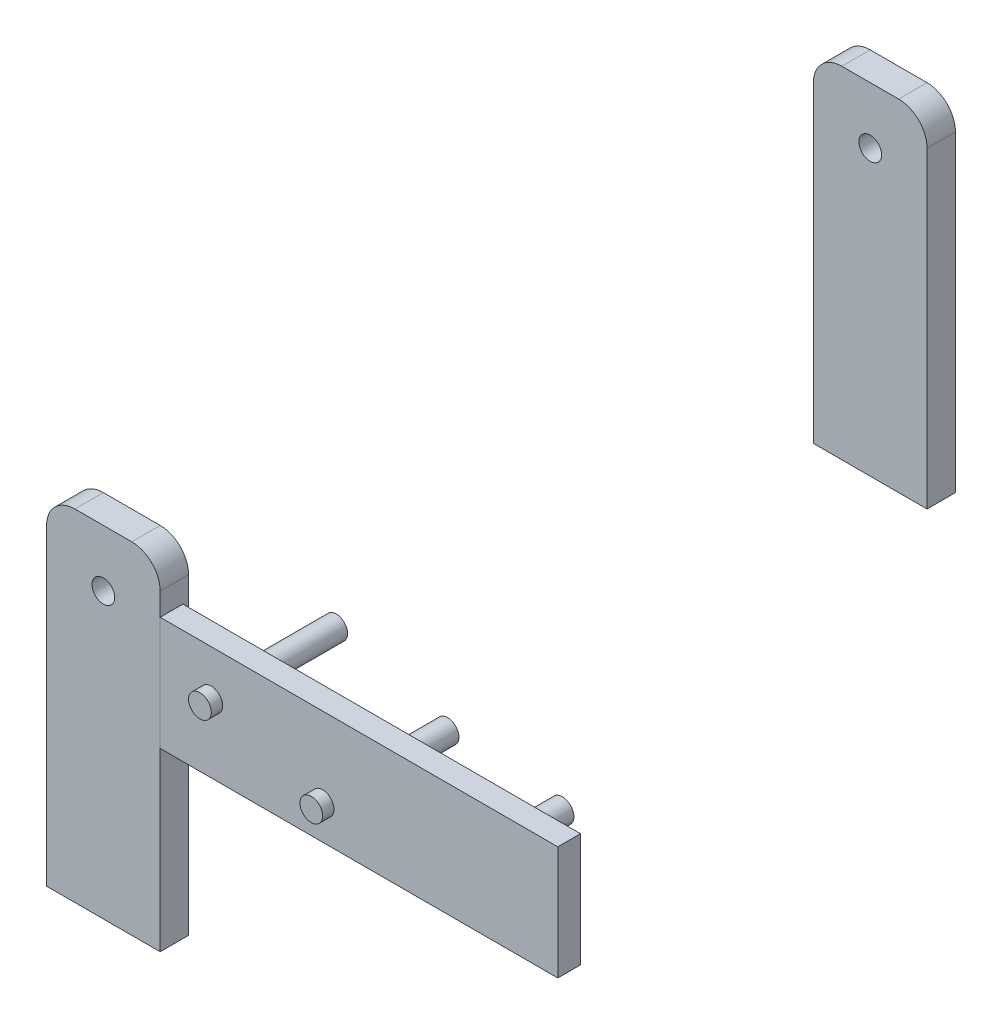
ISO-10303-21;
HEADER;
FILE_DESCRIPTION(('STEP AP214'),'2;1');
FILE_NAME('part.step','',(''),(''),'','','');
FILE_SCHEMA(('AUTOMOTIVE_DESIGN { 1 0 10303 214 1 1 1 1 }'));
ENDSEC;
DATA;
#1=APPLICATION_CONTEXT('core data for automotive mechanical design processes');
#2=APPLICATION_PROTOCOL_DEFINITION('international standard','automotive_design',2000,#1);
#3=PRODUCT_CONTEXT('',#1,'mechanical');
#4=PRODUCT('Part','Part','',(#3));
#5=PRODUCT_RELATED_PRODUCT_CATEGORY('part','',(#4));
#6=PRODUCT_DEFINITION_FORMATION('','',#4);
#7=PRODUCT_DEFINITION_CONTEXT('part definition',#1,'design');
#8=PRODUCT_DEFINITION('design','',#6,#7);
#9=PRODUCT_DEFINITION_SHAPE('','',#8);
#10=(LENGTH_UNIT() NAMED_UNIT(*) SI_UNIT(.MILLI.,.METRE.));
#11=(NAMED_UNIT(*) PLANE_ANGLE_UNIT() SI_UNIT($,.RADIAN.));
#12=(NAMED_UNIT(*) SI_UNIT($,.STERADIAN.) SOLID_ANGLE_UNIT());
#13=UNCERTAINTY_MEASURE_WITH_UNIT(LENGTH_MEASURE(1.E-05),#10,'distance_accuracy_value','');
#14=(GEOMETRIC_REPRESENTATION_CONTEXT(3) GLOBAL_UNCERTAINTY_ASSIGNED_CONTEXT((#13)) GLOBAL_UNIT_ASSIGNED_CONTEXT((#10,
#11,#12)) REPRESENTATION_CONTEXT('',''));
#15=CARTESIAN_POINT('',(0.,0.,0.));
#16=DIRECTION('',(0.,0.,1.));
#17=DIRECTION('',(1.,0.,0.));
#18=AXIS2_PLACEMENT_3D('',#15,#16,#17);
#19=CARTESIAN_POINT('',(44.0575616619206,10.5,68.));
#20=DIRECTION('',(0.,0.,1.));
#21=DIRECTION('',(1.,0.,0.));
#22=AXIS2_PLACEMENT_3D('',#19,#20,#21);
#23=PLANE('',#22);
#24=DIRECTION('',(0.,-1.,0.));
#25=VECTOR('',#24,1.);
#26=CARTESIAN_POINT('',(44.0575616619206,20.5,68.));
#27=LINE('',#26,#25);
#28=CARTESIAN_POINT('',(44.0575616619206,20.5,68.));
#29=VERTEX_POINT('',#28);
#30=CARTESIAN_POINT('',(44.0575616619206,10.5,68.));
#31=VERTEX_POINT('',#30);
#32=EDGE_CURVE('E107',#29,#31,#27,.T.);
#33=ORIENTED_EDGE('',*,*,#32,.F.);
#34=DIRECTION('',(-1.,0.,0.));
#35=VECTOR('',#34,1.);
#36=CARTESIAN_POINT('',(44.0575616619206,20.5,68.));
#37=LINE('',#36,#35);
#38=CARTESIAN_POINT('',(79.0575616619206,20.5,68.));
#39=VERTEX_POINT('',#38);
#40=EDGE_CURVE('E104',#39,#29,#37,.T.);
#41=ORIENTED_EDGE('',*,*,#40,.F.);
#42=DIRECTION('',(0.,1.,0.));
#43=VECTOR('',#42,1.);
#44=CARTESIAN_POINT('',(79.0575616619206,20.5,68.));
#45=LINE('',#44,#43);
#46=CARTESIAN_POINT('',(79.0575616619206,10.5,68.));
#47=VERTEX_POINT('',#46);
#48=EDGE_CURVE('E96',#47,#39,#45,.T.);
#49=ORIENTED_EDGE('',*,*,#48,.F.);
#50=DIRECTION('',(1.,0.,0.));
#51=VECTOR('',#50,1.);
#52=CARTESIAN_POINT('',(44.0575616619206,10.5,68.));
#53=LINE('',#52,#51);
#54=EDGE_CURVE('E103',#31,#47,#53,.T.);
#55=ORIENTED_EDGE('',*,*,#54,.F.);
#56=EDGE_LOOP('',(#33,#41,#49,#55));
#57=FACE_BOUND('',#56,.T.);
#58=CARTESIAN_POINT('',(48.5575616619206,16.5,68.));
#59=DIRECTION('',(0.,0.,1.));
#60=DIRECTION('',(1.,0.,0.));
#61=AXIS2_PLACEMENT_3D('',#58,#59,#60);
#62=CIRCLE('',#61,0.999999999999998);
#63=CARTESIAN_POINT('',(49.5575616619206,16.5,68.));
#64=VERTEX_POINT('',#63);
#65=EDGE_CURVE('E118',#64,#64,#62,.T.);
#66=ORIENTED_EDGE('',*,*,#65,.T.);
#67=EDGE_LOOP('',(#66));
#68=FACE_BOUND('',#67,.T.);
#69=CARTESIAN_POINT('',(58.3575616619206,13.5,68.));
#70=DIRECTION('',(0.,0.,1.));
#71=DIRECTION('',(1.,0.,0.));
#72=AXIS2_PLACEMENT_3D('',#69,#70,#71);
#73=CIRCLE('',#72,0.999999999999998);
#74=CARTESIAN_POINT('',(59.3575616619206,13.5,68.));
#75=VERTEX_POINT('',#74);
#76=EDGE_CURVE('E197',#75,#75,#73,.T.);
#77=ORIENTED_EDGE('',*,*,#76,.T.);
#78=EDGE_LOOP('',(#77));
#79=FACE_BOUND('',#78,.T.);
#80=CARTESIAN_POINT('',(68.4575616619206,12.5,68.));
#81=DIRECTION('',(0.,0.,1.));
#82=DIRECTION('',(1.,0.,0.));
#83=AXIS2_PLACEMENT_3D('',#80,#81,#82);
#84=CIRCLE('',#83,1.01884808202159);
#85=CARTESIAN_POINT('',(69.4764097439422,12.5,68.));
#86=VERTEX_POINT('',#85);
#87=EDGE_CURVE('E12',#86,#86,#84,.F.);
#88=ORIENTED_EDGE('',*,*,#87,.F.);
#89=EDGE_LOOP('',(#88));
#90=FACE_BOUND('',#89,.T.);
#91=ADVANCED_FACE('F45',(#57,#68,#79,#90),#23,.F.);
#92=CARTESIAN_POINT('',(44.0575616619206,20.5,68.));
#93=DIRECTION('',(-1.,0.,0.));
#94=DIRECTION('',(0.,0.,1.));
#95=AXIS2_PLACEMENT_3D('',#92,#93,#94);
#96=PLANE('',#95);
#97=DIRECTION('',(0.,-1.,0.));
#98=VECTOR('',#97,1.);
#99=CARTESIAN_POINT('',(44.0575616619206,20.5,70.));
#100=LINE('',#99,#98);
#101=CARTESIAN_POINT('',(44.0575616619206,20.5,70.));
#102=VERTEX_POINT('',#101);
#103=CARTESIAN_POINT('',(44.0575616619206,10.5,70.));
#104=VERTEX_POINT('',#103);
#105=EDGE_CURVE('E114',#102,#104,#100,.T.);
#106=ORIENTED_EDGE('',*,*,#105,.F.);
#107=DIRECTION('',(0.,0.,1.));
#108=VECTOR('',#107,1.);
#109=CARTESIAN_POINT('',(44.0575616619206,20.5,68.));
#110=LINE('',#109,#108);
#111=EDGE_CURVE('E62',#29,#102,#110,.T.);
#112=ORIENTED_EDGE('',*,*,#111,.F.);
#113=ORIENTED_EDGE('',*,*,#32,.T.);
#114=DIRECTION('',(0.,0.,1.));
#115=VECTOR('',#114,1.);
#116=CARTESIAN_POINT('',(44.0575616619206,10.5,68.));
#117=LINE('',#116,#115);
#118=EDGE_CURVE('E90',#31,#104,#117,.T.);
#119=ORIENTED_EDGE('',*,*,#118,.T.);
#120=EDGE_LOOP('',(#106,#112,#113,#119));
#121=FACE_BOUND('',#120,.T.);
#122=ADVANCED_FACE('F47',(#121),#96,.T.);
#123=CARTESIAN_POINT('',(44.0575616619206,20.5,68.));
#124=DIRECTION('',(0.,1.,0.));
#125=DIRECTION('',(0.,0.,1.));
#126=AXIS2_PLACEMENT_3D('',#123,#124,#125);
#127=PLANE('',#126);
#128=DIRECTION('',(-1.,0.,0.));
#129=VECTOR('',#128,1.);
#130=CARTESIAN_POINT('',(44.0575616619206,20.5,70.));
#131=LINE('',#130,#129);
#132=CARTESIAN_POINT('',(79.0575616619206,20.5,70.));
#133=VERTEX_POINT('',#132);
#134=EDGE_CURVE('E109',#133,#102,#131,.T.);
#135=ORIENTED_EDGE('',*,*,#134,.F.);
#136=DIRECTION('',(0.,0.,1.));
#137=VECTOR('',#136,1.);
#138=CARTESIAN_POINT('',(79.0575616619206,20.5,68.));
#139=LINE('',#138,#137);
#140=EDGE_CURVE('E79',#39,#133,#139,.T.);
#141=ORIENTED_EDGE('',*,*,#140,.F.);
#142=ORIENTED_EDGE('',*,*,#40,.T.);
#143=ORIENTED_EDGE('',*,*,#111,.T.);
#144=EDGE_LOOP('',(#135,#141,#142,#143));
#145=FACE_BOUND('',#144,.T.);
#146=ADVANCED_FACE('F141',(#145),#127,.T.);
#147=CARTESIAN_POINT('',(79.0575616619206,20.5,68.));
#148=DIRECTION('',(1.,0.,0.));
#149=DIRECTION('',(0.,0.,-1.));
#150=AXIS2_PLACEMENT_3D('',#147,#148,#149);
#151=PLANE('',#150);
#152=DIRECTION('',(0.,1.,0.));
#153=VECTOR('',#152,1.);
#154=CARTESIAN_POINT('',(79.0575616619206,20.5,70.));
#155=LINE('',#154,#153);
#156=CARTESIAN_POINT('',(79.0575616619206,10.5,70.));
#157=VERTEX_POINT('',#156);
#158=EDGE_CURVE('E98',#157,#133,#155,.T.);
#159=ORIENTED_EDGE('',*,*,#158,.F.);
#160=DIRECTION('',(0.,0.,1.));
#161=VECTOR('',#160,1.);
#162=CARTESIAN_POINT('',(79.0575616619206,10.5,68.));
#163=LINE('',#162,#161);
#164=EDGE_CURVE('E93',#47,#157,#163,.T.);
#165=ORIENTED_EDGE('',*,*,#164,.F.);
#166=ORIENTED_EDGE('',*,*,#48,.T.);
#167=ORIENTED_EDGE('',*,*,#140,.T.);
#168=EDGE_LOOP('',(#159,#165,#166,#167));
#169=FACE_BOUND('',#168,.T.);
#170=ADVANCED_FACE('F95',(#169),#151,.T.);
#171=CARTESIAN_POINT('',(44.0575616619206,10.5,68.));
#172=DIRECTION('',(0.,-1.,0.));
#173=DIRECTION('',(0.,0.,-1.));
#174=AXIS2_PLACEMENT_3D('',#171,#172,#173);
#175=PLANE('',#174);
#176=DIRECTION('',(1.,0.,0.));
#177=VECTOR('',#176,1.);
#178=CARTESIAN_POINT('',(44.0575616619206,10.5,70.));
#179=LINE('',#178,#177);
#180=EDGE_CURVE('E117',#104,#157,#179,.T.);
#181=ORIENTED_EDGE('',*,*,#180,.F.);
#182=ORIENTED_EDGE('',*,*,#118,.F.);
#183=ORIENTED_EDGE('',*,*,#54,.T.);
#184=ORIENTED_EDGE('',*,*,#164,.T.);
#185=EDGE_LOOP('',(#181,#182,#183,#184));
#186=FACE_BOUND('',#185,.T.);
#187=ADVANCED_FACE('F106',(#186),#175,.T.);
#188=CARTESIAN_POINT('',(44.0575616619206,10.5,70.));
#189=DIRECTION('',(0.,0.,1.));
#190=DIRECTION('',(1.,0.,0.));
#191=AXIS2_PLACEMENT_3D('',#188,#189,#190);
#192=PLANE('',#191);
#193=CARTESIAN_POINT('',(58.3575616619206,13.5,70.));
#194=DIRECTION('',(0.,0.,1.));
#195=DIRECTION('',(1.,0.,0.));
#196=AXIS2_PLACEMENT_3D('',#193,#194,#195);
#197=CIRCLE('',#196,0.999999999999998);
#198=CARTESIAN_POINT('',(59.3575616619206,13.5,70.));
#199=VERTEX_POINT('',#198);
#200=EDGE_CURVE('E54',#199,#199,#197,.T.);
#201=ORIENTED_EDGE('',*,*,#200,.F.);
#202=EDGE_LOOP('',(#201));
#203=FACE_BOUND('',#202,.T.);
#204=CARTESIAN_POINT('',(48.5575616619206,16.5,70.));
#205=DIRECTION('',(0.,0.,1.));
#206=DIRECTION('',(1.,0.,0.));
#207=AXIS2_PLACEMENT_3D('',#204,#205,#206);
#208=CIRCLE('',#207,0.999999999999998);
#209=CARTESIAN_POINT('',(49.5575616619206,16.5,70.));
#210=VERTEX_POINT('',#209);
#211=EDGE_CURVE('E124',#210,#210,#208,.T.);
#212=ORIENTED_EDGE('',*,*,#211,.F.);
#213=EDGE_LOOP('',(#212));
#214=FACE_BOUND('',#213,.T.);
#215=ORIENTED_EDGE('',*,*,#105,.T.);
#216=ORIENTED_EDGE('',*,*,#180,.T.);
#217=ORIENTED_EDGE('',*,*,#158,.T.);
#218=ORIENTED_EDGE('',*,*,#134,.T.);
#219=EDGE_LOOP('',(#215,#216,#217,#218));
#220=FACE_BOUND('',#219,.T.);
#221=ADVANCED_FACE('F134',(#203,#214,#220),#192,.T.);
#222=CARTESIAN_POINT('',(48.5575616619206,16.5,71.));
#223=DIRECTION('',(0.,0.,-1.));
#224=DIRECTION('',(-1.,0.,0.));
#225=AXIS2_PLACEMENT_3D('',#222,#223,#224);
#226=PLANE('',#225);
#227=CARTESIAN_POINT('',(48.5575616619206,16.5,71.));
#228=DIRECTION('',(0.,0.,-1.));
#229=DIRECTION('',(-1.,0.,0.));
#230=AXIS2_PLACEMENT_3D('',#227,#228,#229);
#231=CIRCLE('',#230,0.999999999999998);
#232=CARTESIAN_POINT('',(47.5575616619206,16.5,71.));
#233=VERTEX_POINT('',#232);
#234=EDGE_CURVE('E203',#233,#233,#231,.T.);
#235=ORIENTED_EDGE('',*,*,#234,.F.);
#236=EDGE_LOOP('',(#235));
#237=FACE_BOUND('',#236,.T.);
#238=ADVANCED_FACE('F137',(#237),#226,.F.);
#239=CARTESIAN_POINT('',(48.5575616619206,16.5,71.));
#240=DIRECTION('',(0.,0.,-1.));
#241=DIRECTION('',(-1.,0.,0.));
#242=AXIS2_PLACEMENT_3D('',#239,#240,#241);
#243=CYLINDRICAL_SURFACE('',#242,0.999999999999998);
#244=ORIENTED_EDGE('',*,*,#211,.T.);
#245=EDGE_LOOP('',(#244));
#246=FACE_BOUND('',#245,.T.);
#247=ORIENTED_EDGE('',*,*,#234,.T.);
#248=EDGE_LOOP('',(#247));
#249=FACE_BOUND('',#248,.T.);
#250=ADVANCED_FACE('F154',(#246,#249),#243,.T.);
#251=CARTESIAN_POINT('',(48.5575616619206,16.5,59.));
#252=DIRECTION('',(0.,0.,-1.));
#253=DIRECTION('',(-1.,0.,0.));
#254=AXIS2_PLACEMENT_3D('',#251,#252,#253);
#255=CIRCLE('',#254,0.999999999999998);
#256=CARTESIAN_POINT('',(47.5575616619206,16.5,59.));
#257=VERTEX_POINT('',#256);
#258=EDGE_CURVE('E200',#257,#257,#255,.T.);
#259=ORIENTED_EDGE('',*,*,#258,.F.);
#260=EDGE_LOOP('',(#259));
#261=FACE_BOUND('',#260,.T.);
#262=ORIENTED_EDGE('',*,*,#65,.F.);
#263=EDGE_LOOP('',(#262));
#264=FACE_BOUND('',#263,.T.);
#265=ADVANCED_FACE('F157',(#261,#264),#243,.T.);
#266=CARTESIAN_POINT('',(48.5575616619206,16.5,59.));
#267=DIRECTION('',(0.,0.,-1.));
#268=DIRECTION('',(-1.,0.,0.));
#269=AXIS2_PLACEMENT_3D('',#266,#267,#268);
#270=PLANE('',#269);
#271=ORIENTED_EDGE('',*,*,#258,.T.);
#272=EDGE_LOOP('',(#271));
#273=FACE_BOUND('',#272,.T.);
#274=ADVANCED_FACE('F162',(#273),#270,.T.);
#275=CARTESIAN_POINT('',(58.3575616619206,13.5,71.));
#276=DIRECTION('',(0.,0.,-1.));
#277=DIRECTION('',(-1.,0.,0.));
#278=AXIS2_PLACEMENT_3D('',#275,#276,#277);
#279=PLANE('',#278);
#280=CARTESIAN_POINT('',(58.3575616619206,13.5,71.));
#281=DIRECTION('',(0.,0.,-1.));
#282=DIRECTION('',(-1.,0.,0.));
#283=AXIS2_PLACEMENT_3D('',#280,#281,#282);
#284=CIRCLE('',#283,0.999999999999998);
#285=CARTESIAN_POINT('',(57.3575616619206,13.5,71.));
#286=VERTEX_POINT('',#285);
#287=EDGE_CURVE('E192',#286,#286,#284,.T.);
#288=ORIENTED_EDGE('',*,*,#287,.F.);
#289=EDGE_LOOP('',(#288));
#290=FACE_BOUND('',#289,.T.);
#291=ADVANCED_FACE('F165',(#290),#279,.F.);
#292=CARTESIAN_POINT('',(58.3575616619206,13.5,71.));
#293=DIRECTION('',(0.,0.,-1.));
#294=DIRECTION('',(-1.,0.,0.));
#295=AXIS2_PLACEMENT_3D('',#292,#293,#294);
#296=CYLINDRICAL_SURFACE('',#295,0.999999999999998);
#297=ORIENTED_EDGE('',*,*,#200,.T.);
#298=EDGE_LOOP('',(#297));
#299=FACE_BOUND('',#298,.T.);
#300=ORIENTED_EDGE('',*,*,#287,.T.);
#301=EDGE_LOOP('',(#300));
#302=FACE_BOUND('',#301,.T.);
#303=ADVANCED_FACE('F131',(#299,#302),#296,.T.);
#304=CARTESIAN_POINT('',(58.3575616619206,13.5,59.));
#305=DIRECTION('',(0.,0.,-1.));
#306=DIRECTION('',(-1.,0.,0.));
#307=AXIS2_PLACEMENT_3D('',#304,#305,#306);
#308=CIRCLE('',#307,0.999999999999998);
#309=CARTESIAN_POINT('',(57.3575616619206,13.5,59.));
#310=VERTEX_POINT('',#309);
#311=EDGE_CURVE('E189',#310,#310,#308,.T.);
#312=ORIENTED_EDGE('',*,*,#311,.F.);
#313=EDGE_LOOP('',(#312));
#314=FACE_BOUND('',#313,.T.);
#315=ORIENTED_EDGE('',*,*,#76,.F.);
#316=EDGE_LOOP('',(#315));
#317=FACE_BOUND('',#316,.T.);
#318=ADVANCED_FACE('F169',(#314,#317),#296,.T.);
#319=CARTESIAN_POINT('',(58.3575616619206,13.5,59.));
#320=DIRECTION('',(0.,0.,-1.));
#321=DIRECTION('',(-1.,0.,0.));
#322=AXIS2_PLACEMENT_3D('',#319,#320,#321);
#323=PLANE('',#322);
#324=ORIENTED_EDGE('',*,*,#311,.T.);
#325=EDGE_LOOP('',(#324));
#326=FACE_BOUND('',#325,.T.);
#327=ADVANCED_FACE('F173',(#326),#323,.T.);
#328=CARTESIAN_POINT('',(68.4575616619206,12.5,59.));
#329=DIRECTION('',(0.,0.,1.));
#330=DIRECTION('',(1.,0.,0.));
#331=AXIS2_PLACEMENT_3D('',#328,#329,#330);
#332=CYLINDRICAL_SURFACE('',#331,1.01884808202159);
#333=CARTESIAN_POINT('',(68.4575616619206,12.5,59.));
#334=DIRECTION('',(0.,0.,-1.));
#335=DIRECTION('',(-1.,0.,0.));
#336=AXIS2_PLACEMENT_3D('',#333,#334,#335);
#337=CIRCLE('',#336,1.01884808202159);
#338=CARTESIAN_POINT('',(67.438713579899,12.5,59.));
#339=VERTEX_POINT('',#338);
#340=EDGE_CURVE('E188',#339,#339,#337,.T.);
#341=ORIENTED_EDGE('',*,*,#340,.F.);
#342=EDGE_LOOP('',(#341));
#343=FACE_BOUND('',#342,.T.);
#344=ORIENTED_EDGE('',*,*,#87,.T.);
#345=EDGE_LOOP('',(#344));
#346=FACE_BOUND('',#345,.T.);
#347=ADVANCED_FACE('F176',(#343,#346),#332,.T.);
#348=CARTESIAN_POINT('',(68.4575616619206,12.5,59.));
#349=DIRECTION('',(0.,0.,-1.));
#350=DIRECTION('',(-1.,0.,0.));
#351=AXIS2_PLACEMENT_3D('',#348,#349,#350);
#352=PLANE('',#351);
#353=ORIENTED_EDGE('',*,*,#340,.T.);
#354=EDGE_LOOP('',(#353));
#355=FACE_BOUND('',#354,.T.);
#356=ADVANCED_FACE('F180',(#355),#352,.T.);
#357=CLOSED_SHELL('',(#91,#122,#146,#170,#187,#221,#238,#250,#265,#274,#291,#303,#318,#327,#347,#356));
#358=MANIFOLD_SOLID_BREP('B2',#357);
#359=CARTESIAN_POINT('',(41.5575616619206,22.5,67.5));
#360=DIRECTION('',(0.,0.,-1.));
#361=DIRECTION('',(1.,0.,0.));
#362=AXIS2_PLACEMENT_3D('',#359,#360,#361);
#363=PLANE('',#362);
#364=DIRECTION('',(0.,1.,0.));
#365=VECTOR('',#364,1.);
#366=CARTESIAN_POINT('',(44.0575616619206,-5.,67.5));
#367=LINE('',#366,#365);
#368=CARTESIAN_POINT('',(44.0575616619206,-5.,67.5));
#369=VERTEX_POINT('',#368);
#370=CARTESIAN_POINT('',(44.0575616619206,22.5,67.5));
#371=VERTEX_POINT('',#370);
#372=EDGE_CURVE('E425',#369,#371,#367,.T.);
#373=ORIENTED_EDGE('',*,*,#372,.F.);
#374=DIRECTION('',(1.,0.,0.));
#375=VECTOR('',#374,1.);
#376=CARTESIAN_POINT('',(44.0575616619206,-5.,67.5));
#377=LINE('',#376,#375);
#378=CARTESIAN_POINT('',(34.0575616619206,-5.,67.5));
#379=VERTEX_POINT('',#378);
#380=EDGE_CURVE('E405',#379,#369,#377,.T.);
#381=ORIENTED_EDGE('',*,*,#380,.F.);
#382=DIRECTION('',(0.,-1.,0.));
#383=VECTOR('',#382,1.);
#384=CARTESIAN_POINT('',(34.0575616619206,-5.,67.5));
#385=LINE('',#384,#383);
#386=CARTESIAN_POINT('',(34.0575616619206,22.5,67.5));
#387=VERTEX_POINT('',#386);
#388=EDGE_CURVE('E386',#387,#379,#385,.T.);
#389=ORIENTED_EDGE('',*,*,#388,.F.);
#390=CARTESIAN_POINT('',(36.5575616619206,22.5,67.5));
#391=DIRECTION('',(0.,0.,1.));
#392=DIRECTION('',(1.,0.,0.));
#393=AXIS2_PLACEMENT_3D('',#390,#391,#392);
#394=CIRCLE('',#393,2.5);
#395=CARTESIAN_POINT('',(36.5575616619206,25.,67.5));
#396=VERTEX_POINT('',#395);
#397=EDGE_CURVE('E396',#396,#387,#394,.T.);
#398=ORIENTED_EDGE('',*,*,#397,.F.);
#399=DIRECTION('',(-1.,0.,0.));
#400=VECTOR('',#399,1.);
#401=CARTESIAN_POINT('',(41.5575616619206,25.,67.5));
#402=LINE('',#401,#400);
#403=CARTESIAN_POINT('',(41.5575616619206,25.,67.5));
#404=VERTEX_POINT('',#403);
#405=EDGE_CURVE('E401',#404,#396,#402,.T.);
#406=ORIENTED_EDGE('',*,*,#405,.F.);
#407=CARTESIAN_POINT('',(41.5575616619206,22.5,67.5));
#408=DIRECTION('',(0.,0.,1.));
#409=DIRECTION('',(1.,0.,0.));
#410=AXIS2_PLACEMENT_3D('',#407,#408,#409);
#411=CIRCLE('',#410,2.5);
#412=EDGE_CURVE('E430',#371,#404,#411,.T.);
#413=ORIENTED_EDGE('',*,*,#412,.F.);
#414=EDGE_LOOP('',(#373,#381,#389,#398,#406,#413));
#415=FACE_BOUND('',#414,.T.);
#416=CARTESIAN_POINT('',(39.0575616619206,20.,67.5));
#417=DIRECTION('',(0.,0.,1.));
#418=DIRECTION('',(1.,0.,0.));
#419=AXIS2_PLACEMENT_3D('',#416,#417,#418);
#420=CIRCLE('',#419,0.999999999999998);
#421=CARTESIAN_POINT('',(40.0575616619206,20.,67.5));
#422=VERTEX_POINT('',#421);
#423=EDGE_CURVE('E414',#422,#422,#420,.T.);
#424=ORIENTED_EDGE('',*,*,#423,.T.);
#425=EDGE_LOOP('',(#424));
#426=FACE_BOUND('',#425,.T.);
#427=ADVANCED_FACE('F325',(#415,#426),#363,.T.);
#428=CARTESIAN_POINT('',(41.5575616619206,22.5,70.));
#429=DIRECTION('',(0.,0.,-1.));
#430=DIRECTION('',(1.,0.,0.));
#431=AXIS2_PLACEMENT_3D('',#428,#429,#430);
#432=PLANE('',#431);
#433=DIRECTION('',(0.,1.,0.));
#434=VECTOR('',#433,1.);
#435=CARTESIAN_POINT('',(44.0575616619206,-5.,70.));
#436=LINE('',#435,#434);
#437=CARTESIAN_POINT('',(44.0575616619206,-5.,70.));
#438=VERTEX_POINT('',#437);
#439=CARTESIAN_POINT('',(44.0575616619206,22.5,70.));
#440=VERTEX_POINT('',#439);
#441=EDGE_CURVE('E410',#438,#440,#436,.T.);
#442=ORIENTED_EDGE('',*,*,#441,.T.);
#443=CARTESIAN_POINT('',(41.5575616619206,22.5,70.));
#444=DIRECTION('',(0.,0.,1.));
#445=DIRECTION('',(1.,0.,0.));
#446=AXIS2_PLACEMENT_3D('',#443,#444,#445);
#447=CIRCLE('',#446,2.5);
#448=CARTESIAN_POINT('',(41.5575616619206,25.,70.));
#449=VERTEX_POINT('',#448);
#450=EDGE_CURVE('E413',#440,#449,#447,.T.);
#451=ORIENTED_EDGE('',*,*,#450,.T.);
#452=DIRECTION('',(-1.,0.,0.));
#453=VECTOR('',#452,1.);
#454=CARTESIAN_POINT('',(41.5575616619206,25.,70.));
#455=LINE('',#454,#453);
#456=CARTESIAN_POINT('',(36.5575616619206,25.,70.));
#457=VERTEX_POINT('',#456);
#458=EDGE_CURVE('E417',#449,#457,#455,.T.);
#459=ORIENTED_EDGE('',*,*,#458,.T.);
#460=CARTESIAN_POINT('',(36.5575616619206,22.5,70.));
#461=DIRECTION('',(0.,0.,1.));
#462=DIRECTION('',(1.,0.,0.));
#463=AXIS2_PLACEMENT_3D('',#460,#461,#462);
#464=CIRCLE('',#463,2.5);
#465=CARTESIAN_POINT('',(34.0575616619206,22.5,70.));
#466=VERTEX_POINT('',#465);
#467=EDGE_CURVE('E420',#457,#466,#464,.T.);
#468=ORIENTED_EDGE('',*,*,#467,.T.);
#469=DIRECTION('',(0.,-1.,0.));
#470=VECTOR('',#469,1.);
#471=CARTESIAN_POINT('',(34.0575616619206,-5.,70.));
#472=LINE('',#471,#470);
#473=CARTESIAN_POINT('',(34.0575616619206,-5.,70.));
#474=VERTEX_POINT('',#473);
#475=EDGE_CURVE('E389',#466,#474,#472,.T.);
#476=ORIENTED_EDGE('',*,*,#475,.T.);
#477=DIRECTION('',(1.,0.,0.));
#478=VECTOR('',#477,1.);
#479=CARTESIAN_POINT('',(44.0575616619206,-5.,70.));
#480=LINE('',#479,#478);
#481=EDGE_CURVE('E423',#474,#438,#480,.T.);
#482=ORIENTED_EDGE('',*,*,#481,.T.);
#483=EDGE_LOOP('',(#442,#451,#459,#468,#476,#482));
#484=FACE_BOUND('',#483,.T.);
#485=CARTESIAN_POINT('',(39.0575616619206,20.,70.));
#486=DIRECTION('',(0.,0.,1.));
#487=DIRECTION('',(1.,0.,0.));
#488=AXIS2_PLACEMENT_3D('',#485,#486,#487);
#489=CIRCLE('',#488,0.999999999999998);
#490=CARTESIAN_POINT('',(40.0575616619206,20.,70.));
#491=VERTEX_POINT('',#490);
#492=EDGE_CURVE('E439',#491,#491,#489,.T.);
#493=ORIENTED_EDGE('',*,*,#492,.F.);
#494=EDGE_LOOP('',(#493));
#495=FACE_BOUND('',#494,.T.);
#496=ADVANCED_FACE('F434',(#484,#495),#432,.F.);
#497=CARTESIAN_POINT('',(44.0575616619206,-5.,67.5));
#498=DIRECTION('',(-1.,0.,0.));
#499=DIRECTION('',(0.,0.,-1.));
#500=AXIS2_PLACEMENT_3D('',#497,#498,#499);
#501=PLANE('',#500);
#502=ORIENTED_EDGE('',*,*,#441,.F.);
#503=DIRECTION('',(0.,0.,1.));
#504=VECTOR('',#503,1.);
#505=CARTESIAN_POINT('',(44.0575616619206,-5.,67.5));
#506=LINE('',#505,#504);
#507=EDGE_CURVE('E342',#369,#438,#506,.T.);
#508=ORIENTED_EDGE('',*,*,#507,.F.);
#509=ORIENTED_EDGE('',*,*,#372,.T.);
#510=DIRECTION('',(0.,0.,1.));
#511=VECTOR('',#510,1.);
#512=CARTESIAN_POINT('',(44.0575616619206,22.5,67.5));
#513=LINE('',#512,#511);
#514=EDGE_CURVE('E43',#371,#440,#513,.T.);
#515=ORIENTED_EDGE('',*,*,#514,.T.);
#516=EDGE_LOOP('',(#502,#508,#509,#515));
#517=FACE_BOUND('',#516,.T.);
#518=ADVANCED_FACE('F327',(#517),#501,.F.);
#519=CARTESIAN_POINT('',(41.5575616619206,22.5,67.5));
#520=DIRECTION('',(0.,0.,1.));
#521=DIRECTION('',(-1.,0.,0.));
#522=AXIS2_PLACEMENT_3D('',#519,#520,#521);
#523=CYLINDRICAL_SURFACE('',#522,2.5);
#524=ORIENTED_EDGE('',*,*,#450,.F.);
#525=ORIENTED_EDGE('',*,*,#514,.F.);
#526=ORIENTED_EDGE('',*,*,#412,.T.);
#527=DIRECTION('',(0.,0.,1.));
#528=VECTOR('',#527,1.);
#529=CARTESIAN_POINT('',(41.5575616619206,25.,67.5));
#530=LINE('',#529,#528);
#531=EDGE_CURVE('E334',#404,#449,#530,.T.);
#532=ORIENTED_EDGE('',*,*,#531,.T.);
#533=EDGE_LOOP('',(#524,#525,#526,#532));
#534=FACE_BOUND('',#533,.T.);
#535=ADVANCED_FACE('F429',(#534),#523,.T.);
#536=CARTESIAN_POINT('',(41.5575616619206,25.,67.5));
#537=DIRECTION('',(0.,-1.,0.));
#538=DIRECTION('',(0.,0.,1.));
#539=AXIS2_PLACEMENT_3D('',#536,#537,#538);
#540=PLANE('',#539);
#541=ORIENTED_EDGE('',*,*,#458,.F.);
#542=ORIENTED_EDGE('',*,*,#531,.F.);
#543=ORIENTED_EDGE('',*,*,#405,.T.);
#544=DIRECTION('',(0.,0.,1.));
#545=VECTOR('',#544,1.);
#546=CARTESIAN_POINT('',(36.5575616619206,25.,67.5));
#547=LINE('',#546,#545);
#548=EDGE_CURVE('E393',#396,#457,#547,.T.);
#549=ORIENTED_EDGE('',*,*,#548,.T.);
#550=EDGE_LOOP('',(#541,#542,#543,#549));
#551=FACE_BOUND('',#550,.T.);
#552=ADVANCED_FACE('F432',(#551),#540,.F.);
#553=CARTESIAN_POINT('',(36.5575616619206,22.5,67.5));
#554=DIRECTION('',(0.,0.,1.));
#555=DIRECTION('',(-1.,0.,0.));
#556=AXIS2_PLACEMENT_3D('',#553,#554,#555);
#557=CYLINDRICAL_SURFACE('',#556,2.5);
#558=ORIENTED_EDGE('',*,*,#467,.F.);
#559=ORIENTED_EDGE('',*,*,#548,.F.);
#560=ORIENTED_EDGE('',*,*,#397,.T.);
#561=DIRECTION('',(0.,0.,1.));
#562=VECTOR('',#561,1.);
#563=CARTESIAN_POINT('',(34.0575616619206,22.5,67.5));
#564=LINE('',#563,#562);
#565=EDGE_CURVE('E382',#387,#466,#564,.T.);
#566=ORIENTED_EDGE('',*,*,#565,.T.);
#567=EDGE_LOOP('',(#558,#559,#560,#566));
#568=FACE_BOUND('',#567,.T.);
#569=ADVANCED_FACE('F397',(#568),#557,.T.);
#570=CARTESIAN_POINT('',(34.0575616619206,-5.,67.5));
#571=DIRECTION('',(1.,0.,0.));
#572=DIRECTION('',(0.,0.,1.));
#573=AXIS2_PLACEMENT_3D('',#570,#571,#572);
#574=PLANE('',#573);
#575=ORIENTED_EDGE('',*,*,#475,.F.);
#576=ORIENTED_EDGE('',*,*,#565,.F.);
#577=ORIENTED_EDGE('',*,*,#388,.T.);
#578=DIRECTION('',(0.,0.,1.));
#579=VECTOR('',#578,1.);
#580=CARTESIAN_POINT('',(34.0575616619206,-5.,67.5));
#581=LINE('',#580,#579);
#582=EDGE_CURVE('E364',#379,#474,#581,.T.);
#583=ORIENTED_EDGE('',*,*,#582,.T.);
#584=EDGE_LOOP('',(#575,#576,#577,#583));
#585=FACE_BOUND('',#584,.T.);
#586=ADVANCED_FACE('F384',(#585),#574,.F.);
#587=CARTESIAN_POINT('',(44.0575616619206,-5.,67.5));
#588=DIRECTION('',(0.,1.,0.));
#589=DIRECTION('',(0.,0.,-1.));
#590=AXIS2_PLACEMENT_3D('',#587,#588,#589);
#591=PLANE('',#590);
#592=ORIENTED_EDGE('',*,*,#481,.F.);
#593=ORIENTED_EDGE('',*,*,#582,.F.);
#594=ORIENTED_EDGE('',*,*,#380,.T.);
#595=ORIENTED_EDGE('',*,*,#507,.T.);
#596=EDGE_LOOP('',(#592,#593,#594,#595));
#597=FACE_BOUND('',#596,.T.);
#598=ADVANCED_FACE('F448',(#597),#591,.F.);
#599=CARTESIAN_POINT('',(39.0575616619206,20.,67.5));
#600=DIRECTION('',(0.,0.,1.));
#601=DIRECTION('',(-1.,0.,0.));
#602=AXIS2_PLACEMENT_3D('',#599,#600,#601);
#603=CYLINDRICAL_SURFACE('',#602,0.999999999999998);
#604=ORIENTED_EDGE('',*,*,#423,.F.);
#605=EDGE_LOOP('',(#604));
#606=FACE_BOUND('',#605,.T.);
#607=ORIENTED_EDGE('',*,*,#492,.T.);
#608=EDGE_LOOP('',(#607));
#609=FACE_BOUND('',#608,.T.);
#610=ADVANCED_FACE('F445',(#606,#609),#603,.F.);
#611=CLOSED_SHELL('',(#427,#496,#518,#535,#552,#569,#586,#598,#610));
#612=MANIFOLD_SOLID_BREP('B6',#611);
#613=CARTESIAN_POINT('',(41.5575616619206,22.5,2.5));
#614=DIRECTION('',(0.,0.,1.));
#615=DIRECTION('',(1.,0.,0.));
#616=AXIS2_PLACEMENT_3D('',#613,#614,#615);
#617=PLANE('',#616);
#618=DIRECTION('',(0.,1.,0.));
#619=VECTOR('',#618,1.);
#620=CARTESIAN_POINT('',(44.0575616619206,-5.,2.5));
#621=LINE('',#620,#619);
#622=CARTESIAN_POINT('',(44.0575616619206,-5.,2.5));
#623=VERTEX_POINT('',#622);
#624=CARTESIAN_POINT('',(44.0575616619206,22.5,2.5));
#625=VERTEX_POINT('',#624);
#626=EDGE_CURVE('E635',#623,#625,#621,.T.);
#627=ORIENTED_EDGE('',*,*,#626,.T.);
#628=CARTESIAN_POINT('',(41.5575616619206,22.5,2.5));
#629=DIRECTION('',(0.,0.,1.));
#630=DIRECTION('',(1.,0.,0.));
#631=AXIS2_PLACEMENT_3D('',#628,#629,#630);
#632=CIRCLE('',#631,2.5);
#633=CARTESIAN_POINT('',(41.5575616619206,25.,2.5));
#634=VERTEX_POINT('',#633);
#635=EDGE_CURVE('E593',#625,#634,#632,.T.);
#636=ORIENTED_EDGE('',*,*,#635,.T.);
#637=DIRECTION('',(-1.,0.,0.));
#638=VECTOR('',#637,1.);
#639=CARTESIAN_POINT('',(41.5575616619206,25.,2.5));
#640=LINE('',#639,#638);
#641=CARTESIAN_POINT('',(36.5575616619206,25.,2.5));
#642=VERTEX_POINT('',#641);
#643=EDGE_CURVE('E606',#634,#642,#640,.T.);
#644=ORIENTED_EDGE('',*,*,#643,.T.);
#645=CARTESIAN_POINT('',(36.5575616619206,22.5,2.5));
#646=DIRECTION('',(0.,0.,1.));
#647=DIRECTION('',(1.,0.,0.));
#648=AXIS2_PLACEMENT_3D('',#645,#646,#647);
#649=CIRCLE('',#648,2.5);
#650=CARTESIAN_POINT('',(34.0575616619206,22.5,2.5));
#651=VERTEX_POINT('',#650);
#652=EDGE_CURVE('E600',#642,#651,#649,.T.);
#653=ORIENTED_EDGE('',*,*,#652,.T.);
#654=DIRECTION('',(0.,-1.,0.));
#655=VECTOR('',#654,1.);
#656=CARTESIAN_POINT('',(34.0575616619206,-5.,2.5));
#657=LINE('',#656,#655);
#658=CARTESIAN_POINT('',(34.0575616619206,-5.,2.5));
#659=VERTEX_POINT('',#658);
#660=EDGE_CURVE('E604',#651,#659,#657,.T.);
#661=ORIENTED_EDGE('',*,*,#660,.T.);
#662=DIRECTION('',(1.,0.,0.));
#663=VECTOR('',#662,1.);
#664=CARTESIAN_POINT('',(44.0575616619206,-5.,2.5));
#665=LINE('',#664,#663);
#666=EDGE_CURVE('E556',#659,#623,#665,.T.);
#667=ORIENTED_EDGE('',*,*,#666,.T.);
#668=EDGE_LOOP('',(#627,#636,#644,#653,#661,#667));
#669=FACE_BOUND('',#668,.T.);
#670=CARTESIAN_POINT('',(39.0575616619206,20.,2.5));
#671=DIRECTION('',(0.,0.,1.));
#672=DIRECTION('',(1.,0.,0.));
#673=AXIS2_PLACEMENT_3D('',#670,#671,#672);
#674=CIRCLE('',#673,0.999999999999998);
#675=CARTESIAN_POINT('',(40.0575616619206,20.,2.5));
#676=VERTEX_POINT('',#675);
#677=EDGE_CURVE('E628',#676,#676,#674,.T.);
#678=ORIENTED_EDGE('',*,*,#677,.F.);
#679=EDGE_LOOP('',(#678));
#680=FACE_BOUND('',#679,.T.);
#681=ADVANCED_FACE('F539',(#669,#680),#617,.T.);
#682=CARTESIAN_POINT('',(41.5575616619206,22.5,0.));
#683=DIRECTION('',(0.,0.,1.));
#684=DIRECTION('',(1.,0.,0.));
#685=AXIS2_PLACEMENT_3D('',#682,#683,#684);
#686=PLANE('',#685);
#687=DIRECTION('',(0.,1.,0.));
#688=VECTOR('',#687,1.);
#689=CARTESIAN_POINT('',(44.0575616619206,-5.,0.));
#690=LINE('',#689,#688);
#691=CARTESIAN_POINT('',(44.0575616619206,-5.,0.));
#692=VERTEX_POINT('',#691);
#693=CARTESIAN_POINT('',(44.0575616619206,22.5,0.));
#694=VERTEX_POINT('',#693);
#695=EDGE_CURVE('E624',#692,#694,#690,.T.);
#696=ORIENTED_EDGE('',*,*,#695,.F.);
#697=DIRECTION('',(1.,0.,0.));
#698=VECTOR('',#697,1.);
#699=CARTESIAN_POINT('',(44.0575616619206,-5.,0.));
#700=LINE('',#699,#698);
#701=CARTESIAN_POINT('',(34.0575616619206,-5.,0.));
#702=VERTEX_POINT('',#701);
#703=EDGE_CURVE('E585',#702,#692,#700,.T.);
#704=ORIENTED_EDGE('',*,*,#703,.F.);
#705=DIRECTION('',(0.,-1.,0.));
#706=VECTOR('',#705,1.);
#707=CARTESIAN_POINT('',(34.0575616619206,-5.,0.));
#708=LINE('',#707,#706);
#709=CARTESIAN_POINT('',(34.0575616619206,22.5,0.));
#710=VERTEX_POINT('',#709);
#711=EDGE_CURVE('E579',#710,#702,#708,.T.);
#712=ORIENTED_EDGE('',*,*,#711,.F.);
#713=CARTESIAN_POINT('',(36.5575616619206,22.5,0.));
#714=DIRECTION('',(0.,0.,1.));
#715=DIRECTION('',(1.,0.,0.));
#716=AXIS2_PLACEMENT_3D('',#713,#714,#715);
#717=CIRCLE('',#716,2.5);
#718=CARTESIAN_POINT('',(36.5575616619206,25.,0.));
#719=VERTEX_POINT('',#718);
#720=EDGE_CURVE('E614',#719,#710,#717,.T.);
#721=ORIENTED_EDGE('',*,*,#720,.F.);
#722=DIRECTION('',(-1.,0.,0.));
#723=VECTOR('',#722,1.);
#724=CARTESIAN_POINT('',(41.5575616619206,25.,0.));
#725=LINE('',#724,#723);
#726=CARTESIAN_POINT('',(41.5575616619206,25.,0.));
#727=VERTEX_POINT('',#726);
#728=EDGE_CURVE('E630',#727,#719,#725,.T.);
#729=ORIENTED_EDGE('',*,*,#728,.F.);
#730=CARTESIAN_POINT('',(41.5575616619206,22.5,0.));
#731=DIRECTION('',(0.,0.,1.));
#732=DIRECTION('',(1.,0.,0.));
#733=AXIS2_PLACEMENT_3D('',#730,#731,#732);
#734=CIRCLE('',#733,2.5);
#735=EDGE_CURVE('E627',#694,#727,#734,.T.);
#736=ORIENTED_EDGE('',*,*,#735,.F.);
#737=EDGE_LOOP('',(#696,#704,#712,#721,#729,#736));
#738=FACE_BOUND('',#737,.T.);
#739=CARTESIAN_POINT('',(39.0575616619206,20.,0.));
#740=DIRECTION('',(0.,0.,1.));
#741=DIRECTION('',(1.,0.,0.));
#742=AXIS2_PLACEMENT_3D('',#739,#740,#741);
#743=CIRCLE('',#742,0.999999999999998);
#744=CARTESIAN_POINT('',(40.0575616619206,20.,0.));
#745=VERTEX_POINT('',#744);
#746=EDGE_CURVE('E728',#745,#745,#743,.T.);
#747=ORIENTED_EDGE('',*,*,#746,.T.);
#748=EDGE_LOOP('',(#747));
#749=FACE_BOUND('',#748,.T.);
#750=ADVANCED_FACE('F644',(#738,#749),#686,.F.);
#751=CARTESIAN_POINT('',(44.0575616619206,-5.,2.5));
#752=DIRECTION('',(-1.,0.,0.));
#753=DIRECTION('',(0.,0.,1.));
#754=AXIS2_PLACEMENT_3D('',#751,#752,#753);
#755=PLANE('',#754);
#756=ORIENTED_EDGE('',*,*,#695,.T.);
#757=DIRECTION('',(0.,0.,-1.));
#758=VECTOR('',#757,1.);
#759=CARTESIAN_POINT('',(44.0575616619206,22.5,2.5));
#760=LINE('',#759,#758);
#761=EDGE_CURVE('E323',#625,#694,#760,.T.);
#762=ORIENTED_EDGE('',*,*,#761,.F.);
#763=ORIENTED_EDGE('',*,*,#626,.F.);
#764=DIRECTION('',(0.,0.,-1.));
#765=VECTOR('',#764,1.);
#766=CARTESIAN_POINT('',(44.0575616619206,-5.,2.5));
#767=LINE('',#766,#765);
#768=EDGE_CURVE('E620',#623,#692,#767,.T.);
#769=ORIENTED_EDGE('',*,*,#768,.T.);
#770=EDGE_LOOP('',(#756,#762,#763,#769));
#771=FACE_BOUND('',#770,.T.);
#772=ADVANCED_FACE('F541',(#771),#755,.F.);
#773=CARTESIAN_POINT('',(41.5575616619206,22.5,2.5));
#774=DIRECTION('',(0.,0.,-1.));
#775=DIRECTION('',(-1.,0.,0.));
#776=AXIS2_PLACEMENT_3D('',#773,#774,#775);
#777=CYLINDRICAL_SURFACE('',#776,2.5);
#778=ORIENTED_EDGE('',*,*,#735,.T.);
#779=DIRECTION('',(0.,0.,-1.));
#780=VECTOR('',#779,1.);
#781=CARTESIAN_POINT('',(41.5575616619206,25.,2.5));
#782=LINE('',#781,#780);
#783=EDGE_CURVE('E548',#634,#727,#782,.T.);
#784=ORIENTED_EDGE('',*,*,#783,.F.);
#785=ORIENTED_EDGE('',*,*,#635,.F.);
#786=ORIENTED_EDGE('',*,*,#761,.T.);
#787=EDGE_LOOP('',(#778,#784,#785,#786));
#788=FACE_BOUND('',#787,.T.);
#789=ADVANCED_FACE('F669',(#788),#777,.T.);
#790=CARTESIAN_POINT('',(41.5575616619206,25.,2.5));
#791=DIRECTION('',(0.,-1.,0.));
#792=DIRECTION('',(0.,0.,-1.));
#793=AXIS2_PLACEMENT_3D('',#790,#791,#792);
#794=PLANE('',#793);
#795=ORIENTED_EDGE('',*,*,#728,.T.);
#796=DIRECTION('',(0.,0.,-1.));
#797=VECTOR('',#796,1.);
#798=CARTESIAN_POINT('',(36.5575616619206,25.,2.5));
#799=LINE('',#798,#797);
#800=EDGE_CURVE('E615',#642,#719,#799,.T.);
#801=ORIENTED_EDGE('',*,*,#800,.F.);
#802=ORIENTED_EDGE('',*,*,#643,.F.);
#803=ORIENTED_EDGE('',*,*,#783,.T.);
#804=EDGE_LOOP('',(#795,#801,#802,#803));
#805=FACE_BOUND('',#804,.T.);
#806=ADVANCED_FACE('F641',(#805),#794,.F.);
#807=CARTESIAN_POINT('',(36.5575616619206,22.5,2.5));
#808=DIRECTION('',(0.,0.,-1.));
#809=DIRECTION('',(-1.,0.,0.));
#810=AXIS2_PLACEMENT_3D('',#807,#808,#809);
#811=CYLINDRICAL_SURFACE('',#810,2.5);
#812=ORIENTED_EDGE('',*,*,#720,.T.);
#813=DIRECTION('',(0.,0.,-1.));
#814=VECTOR('',#813,1.);
#815=CARTESIAN_POINT('',(34.0575616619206,22.5,2.5));
#816=LINE('',#815,#814);
#817=EDGE_CURVE('E611',#651,#710,#816,.T.);
#818=ORIENTED_EDGE('',*,*,#817,.F.);
#819=ORIENTED_EDGE('',*,*,#652,.F.);
#820=ORIENTED_EDGE('',*,*,#800,.T.);
#821=EDGE_LOOP('',(#812,#818,#819,#820));
#822=FACE_BOUND('',#821,.T.);
#823=ADVANCED_FACE('F612',(#822),#811,.T.);
#824=CARTESIAN_POINT('',(34.0575616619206,-5.,2.5));
#825=DIRECTION('',(1.,0.,0.));
#826=DIRECTION('',(0.,0.,-1.));
#827=AXIS2_PLACEMENT_3D('',#824,#825,#826);
#828=PLANE('',#827);
#829=ORIENTED_EDGE('',*,*,#711,.T.);
#830=DIRECTION('',(0.,0.,-1.));
#831=VECTOR('',#830,1.);
#832=CARTESIAN_POINT('',(34.0575616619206,-5.,2.5));
#833=LINE('',#832,#831);
#834=EDGE_CURVE('E616',#659,#702,#833,.T.);
#835=ORIENTED_EDGE('',*,*,#834,.F.);
#836=ORIENTED_EDGE('',*,*,#660,.F.);
#837=ORIENTED_EDGE('',*,*,#817,.T.);
#838=EDGE_LOOP('',(#829,#835,#836,#837));
#839=FACE_BOUND('',#838,.T.);
#840=ADVANCED_FACE('F618',(#839),#828,.F.);
#841=CARTESIAN_POINT('',(44.0575616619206,-5.,2.5));
#842=DIRECTION('',(0.,1.,0.));
#843=DIRECTION('',(0.,0.,1.));
#844=AXIS2_PLACEMENT_3D('',#841,#842,#843);
#845=PLANE('',#844);
#846=ORIENTED_EDGE('',*,*,#703,.T.);
#847=ORIENTED_EDGE('',*,*,#768,.F.);
#848=ORIENTED_EDGE('',*,*,#666,.F.);
#849=ORIENTED_EDGE('',*,*,#834,.T.);
#850=EDGE_LOOP('',(#846,#847,#848,#849));
#851=FACE_BOUND('',#850,.T.);
#852=ADVANCED_FACE('F649',(#851),#845,.F.);
#853=CARTESIAN_POINT('',(39.0575616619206,20.,2.5));
#854=DIRECTION('',(0.,0.,-1.));
#855=DIRECTION('',(-1.,0.,0.));
#856=AXIS2_PLACEMENT_3D('',#853,#854,#855);
#857=CYLINDRICAL_SURFACE('',#856,0.999999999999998);
#858=ORIENTED_EDGE('',*,*,#677,.T.);
#859=EDGE_LOOP('',(#858));
#860=FACE_BOUND('',#859,.T.);
#861=ORIENTED_EDGE('',*,*,#746,.F.);
#862=EDGE_LOOP('',(#861));
#863=FACE_BOUND('',#862,.T.);
#864=ADVANCED_FACE('F651',(#860,#863),#857,.F.);
#865=CLOSED_SHELL('',(#681,#750,#772,#789,#806,#823,#840,#852,#864));
#866=MANIFOLD_SOLID_BREP('B37',#865);
#867=ADVANCED_BREP_SHAPE_REPRESENTATION('',(#18,#358,#612,#866),#14);
#868=SHAPE_DEFINITION_REPRESENTATION(#9,#867);
ENDSEC;
END-ISO-10303-21;
